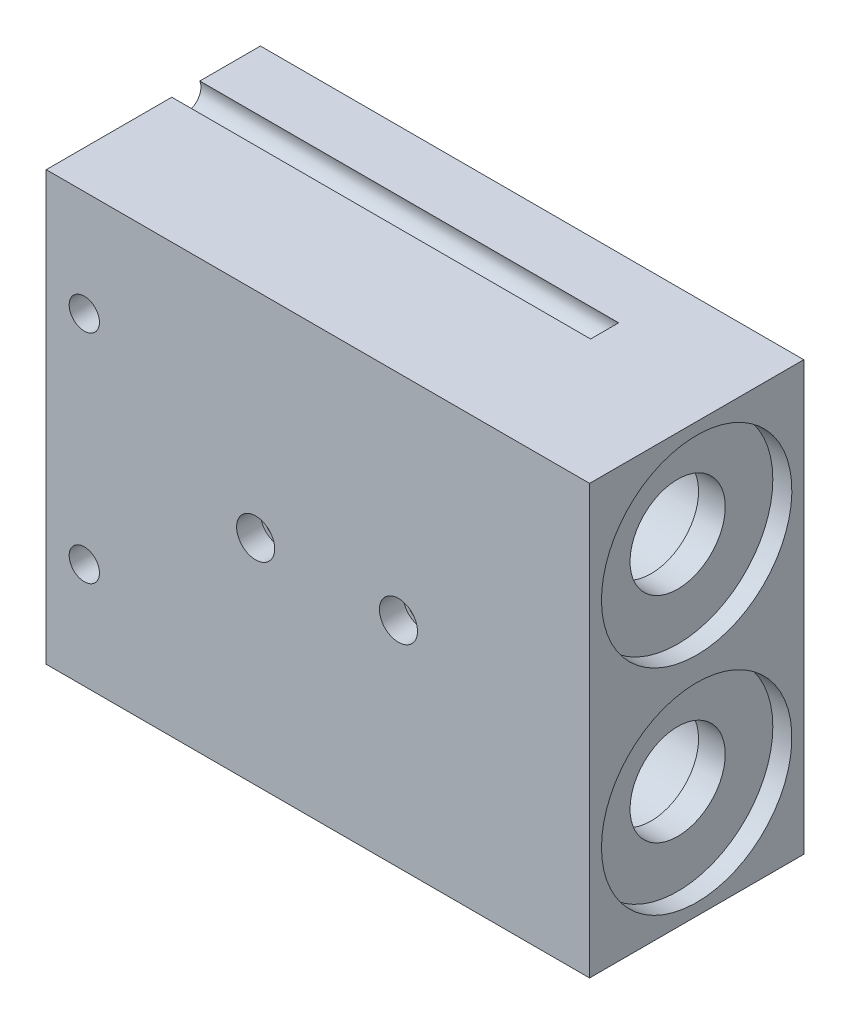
ISO-10303-21;
HEADER;
FILE_DESCRIPTION(('STEP AP214'),'2;1');
FILE_NAME('part.step','',(''),(''),'','','');
FILE_SCHEMA(('AUTOMOTIVE_DESIGN { 1 0 10303 214 1 1 1 1 }'));
ENDSEC;
DATA;
#1=APPLICATION_CONTEXT('core data for automotive mechanical design processes');
#2=APPLICATION_PROTOCOL_DEFINITION('international standard','automotive_design',2000,#1);
#3=PRODUCT_CONTEXT('',#1,'mechanical');
#4=PRODUCT('Part','Part','',(#3));
#5=PRODUCT_RELATED_PRODUCT_CATEGORY('part','',(#4));
#6=PRODUCT_DEFINITION_FORMATION('','',#4);
#7=PRODUCT_DEFINITION_CONTEXT('part definition',#1,'design');
#8=PRODUCT_DEFINITION('design','',#6,#7);
#9=PRODUCT_DEFINITION_SHAPE('','',#8);
#10=(LENGTH_UNIT() NAMED_UNIT(*) SI_UNIT(.MILLI.,.METRE.));
#11=(NAMED_UNIT(*) PLANE_ANGLE_UNIT() SI_UNIT($,.RADIAN.));
#12=(NAMED_UNIT(*) SI_UNIT($,.STERADIAN.) SOLID_ANGLE_UNIT());
#13=UNCERTAINTY_MEASURE_WITH_UNIT(LENGTH_MEASURE(1.E-05),#10,'distance_accuracy_value','');
#14=(GEOMETRIC_REPRESENTATION_CONTEXT(3) GLOBAL_UNCERTAINTY_ASSIGNED_CONTEXT((#13)) GLOBAL_UNIT_ASSIGNED_CONTEXT((#10,
#11,#12)) REPRESENTATION_CONTEXT('',''));
#15=CARTESIAN_POINT('',(0.,0.,0.));
#16=DIRECTION('',(0.,0.,1.));
#17=DIRECTION('',(1.,0.,0.));
#18=AXIS2_PLACEMENT_3D('',#15,#16,#17);
#19=CARTESIAN_POINT('',(-29.1465,-14.4779999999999,7.93749999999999));
#20=DIRECTION('',(0.,0.,1.));
#21=DIRECTION('',(1.,0.,0.));
#22=AXIS2_PLACEMENT_3D('',#19,#20,#21);
#23=PLANE('',#22);
#24=CARTESIAN_POINT('',(-31.1658,-14.4779999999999,7.93749999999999));
#25=DIRECTION('',(0.,0.,-1.));
#26=DIRECTION('',(-1.,0.,0.));
#27=AXIS2_PLACEMENT_3D('',#24,#25,#26);
#28=CIRCLE('',#27,2.0193);
#29=CARTESIAN_POINT('',(-33.1851,-14.4779999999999,7.93749999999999));
#30=VERTEX_POINT('',#29);
#31=EDGE_CURVE('E214',#30,#30,#28,.F.);
#32=ORIENTED_EDGE('',*,*,#31,.T.);
#33=EDGE_LOOP('',(#32));
#34=FACE_BOUND('',#33,.T.);
#35=ADVANCED_FACE('F32',(#34),#23,.T.);
#36=CARTESIAN_POINT('',(-29.1465,14.478,7.93749999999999));
#37=DIRECTION('',(0.,0.,1.));
#38=DIRECTION('',(1.,0.,0.));
#39=AXIS2_PLACEMENT_3D('',#36,#37,#38);
#40=PLANE('',#39);
#41=CARTESIAN_POINT('',(-31.1658,14.478,7.93749999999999));
#42=DIRECTION('',(0.,0.,-1.));
#43=DIRECTION('',(-1.,0.,0.));
#44=AXIS2_PLACEMENT_3D('',#41,#42,#43);
#45=CIRCLE('',#44,2.0193);
#46=CARTESIAN_POINT('',(-33.1851,14.478,7.93749999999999));
#47=VERTEX_POINT('',#46);
#48=EDGE_CURVE('E211',#47,#47,#45,.F.);
#49=ORIENTED_EDGE('',*,*,#48,.T.);
#50=EDGE_LOOP('',(#49));
#51=FACE_BOUND('',#50,.T.);
#52=ADVANCED_FACE('F613',(#51),#40,.T.);
#53=CARTESIAN_POINT('',(-5.76579999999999,0.,11.1125));
#54=DIRECTION('',(0.,0.,1.));
#55=DIRECTION('',(1.,0.,0.));
#56=AXIS2_PLACEMENT_3D('',#53,#54,#55);
#57=PLANE('',#56);
#58=CARTESIAN_POINT('',(-8.3058,0.,11.1125));
#59=DIRECTION('',(0.,0.,-1.));
#60=DIRECTION('',(-1.,0.,0.));
#61=AXIS2_PLACEMENT_3D('',#58,#59,#60);
#62=CIRCLE('',#61,2.0193);
#63=CARTESIAN_POINT('',(-10.3251,0.,11.1125));
#64=VERTEX_POINT('',#63);
#65=EDGE_CURVE('E202',#64,#64,#62,.T.);
#66=ORIENTED_EDGE('',*,*,#65,.T.);
#67=EDGE_LOOP('',(#66));
#68=FACE_BOUND('',#67,.T.);
#69=CARTESIAN_POINT('',(-8.3058,0.,11.1125));
#70=DIRECTION('',(0.,0.,-1.));
#71=DIRECTION('',(-1.,0.,0.));
#72=AXIS2_PLACEMENT_3D('',#69,#70,#71);
#73=CIRCLE('',#72,2.54);
#74=CARTESIAN_POINT('',(-10.8458,0.,11.1125));
#75=VERTEX_POINT('',#74);
#76=EDGE_CURVE('E208',#75,#75,#73,.F.);
#77=ORIENTED_EDGE('',*,*,#76,.T.);
#78=EDGE_LOOP('',(#77));
#79=FACE_BOUND('',#78,.T.);
#80=ADVANCED_FACE('F425',(#68,#79),#57,.T.);
#81=CARTESIAN_POINT('',(13.2842,0.,11.1125));
#82=DIRECTION('',(0.,0.,1.));
#83=DIRECTION('',(1.,0.,0.));
#84=AXIS2_PLACEMENT_3D('',#81,#82,#83);
#85=PLANE('',#84);
#86=CARTESIAN_POINT('',(10.7442,0.,11.1125));
#87=DIRECTION('',(0.,0.,-1.));
#88=DIRECTION('',(-1.,0.,0.));
#89=AXIS2_PLACEMENT_3D('',#86,#87,#88);
#90=CIRCLE('',#89,2.0193);
#91=CARTESIAN_POINT('',(8.72489999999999,0.,11.1125));
#92=VERTEX_POINT('',#91);
#93=EDGE_CURVE('E107',#92,#92,#90,.T.);
#94=ORIENTED_EDGE('',*,*,#93,.T.);
#95=EDGE_LOOP('',(#94));
#96=FACE_BOUND('',#95,.T.);
#97=CARTESIAN_POINT('',(10.7442,0.,11.1125));
#98=DIRECTION('',(0.,0.,-1.));
#99=DIRECTION('',(-1.,0.,0.));
#100=AXIS2_PLACEMENT_3D('',#97,#98,#99);
#101=CIRCLE('',#100,2.54);
#102=CARTESIAN_POINT('',(8.20419999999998,0.,11.1125));
#103=VERTEX_POINT('',#102);
#104=EDGE_CURVE('E205',#103,#103,#101,.F.);
#105=ORIENTED_EDGE('',*,*,#104,.T.);
#106=EDGE_LOOP('',(#105));
#107=FACE_BOUND('',#106,.T.);
#108=ADVANCED_FACE('F416',(#96,#107),#85,.T.);
#109=CARTESIAN_POINT('',(-33.2458,17.4694272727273,-6.6675));
#110=DIRECTION('',(1.,0.,0.));
#111=DIRECTION('',(0.,0.,-1.));
#112=AXIS2_PLACEMENT_3D('',#109,#110,#111);
#113=PLANE('',#112);
#114=CARTESIAN_POINT('',(-33.2458,17.6530000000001,-6.6675));
#115=DIRECTION('',(-1.,0.,0.));
#116=DIRECTION('',(0.,-1.,0.));
#117=AXIS2_PLACEMENT_3D('',#114,#115,#116);
#118=CIRCLE('',#117,2.0193);
#119=CARTESIAN_POINT('',(-33.2458,15.6337000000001,-6.6675));
#120=VERTEX_POINT('',#119);
#121=EDGE_CURVE('E106',#120,#120,#118,.T.);
#122=ORIENTED_EDGE('',*,*,#121,.T.);
#123=EDGE_LOOP('',(#122));
#124=FACE_BOUND('',#123,.T.);
#125=ADVANCED_FACE('F413',(#124),#113,.F.);
#126=CARTESIAN_POINT('',(-33.2458,-11.4865727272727,-6.6675));
#127=DIRECTION('',(1.,0.,0.));
#128=DIRECTION('',(0.,0.,-1.));
#129=AXIS2_PLACEMENT_3D('',#126,#127,#128);
#130=PLANE('',#129);
#131=CARTESIAN_POINT('',(-33.2458,-11.303,-6.6675));
#132=DIRECTION('',(-1.,0.,0.));
#133=DIRECTION('',(0.,-1.,0.));
#134=AXIS2_PLACEMENT_3D('',#131,#132,#133);
#135=CIRCLE('',#134,2.0193);
#136=CARTESIAN_POINT('',(-33.2458,-13.3223,-6.6675));
#137=VERTEX_POINT('',#136);
#138=EDGE_CURVE('E195',#137,#137,#135,.T.);
#139=ORIENTED_EDGE('',*,*,#138,.T.);
#140=EDGE_LOOP('',(#139));
#141=FACE_BOUND('',#140,.T.);
#142=ADVANCED_FACE('F415',(#141),#130,.F.);
#143=CARTESIAN_POINT('',(-31.1658,-14.4779999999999,14.2875));
#144=DIRECTION('',(0.,0.,-1.));
#145=DIRECTION('',(-1.,0.,0.));
#146=AXIS2_PLACEMENT_3D('',#143,#144,#145);
#147=CYLINDRICAL_SURFACE('',#146,2.0193);
#148=CARTESIAN_POINT('',(-31.1658,-14.4779999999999,14.2875));
#149=DIRECTION('',(0.,0.,-1.));
#150=DIRECTION('',(-1.,0.,0.));
#151=AXIS2_PLACEMENT_3D('',#148,#149,#150);
#152=CIRCLE('',#151,2.0193);
#153=CARTESIAN_POINT('',(-33.1851,-14.4779999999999,14.2875));
#154=VERTEX_POINT('',#153);
#155=EDGE_CURVE('E190',#154,#154,#152,.T.);
#156=ORIENTED_EDGE('',*,*,#155,.F.);
#157=EDGE_LOOP('',(#156));
#158=FACE_BOUND('',#157,.T.);
#159=ORIENTED_EDGE('',*,*,#31,.F.);
#160=EDGE_LOOP('',(#159));
#161=FACE_BOUND('',#160,.T.);
#162=ADVANCED_FACE('F422',(#158,#161),#147,.F.);
#163=CARTESIAN_POINT('',(-31.1658,14.478,14.2875));
#164=DIRECTION('',(0.,0.,-1.));
#165=DIRECTION('',(-1.,0.,0.));
#166=AXIS2_PLACEMENT_3D('',#163,#164,#165);
#167=CYLINDRICAL_SURFACE('',#166,2.0193);
#168=CARTESIAN_POINT('',(-31.1658,14.478,14.2875));
#169=DIRECTION('',(0.,0.,-1.));
#170=DIRECTION('',(-1.,0.,0.));
#171=AXIS2_PLACEMENT_3D('',#168,#169,#170);
#172=CIRCLE('',#171,2.0193);
#173=CARTESIAN_POINT('',(-33.1851,14.478,14.2875));
#174=VERTEX_POINT('',#173);
#175=EDGE_CURVE('E187',#174,#174,#172,.T.);
#176=ORIENTED_EDGE('',*,*,#175,.F.);
#177=EDGE_LOOP('',(#176));
#178=FACE_BOUND('',#177,.T.);
#179=ORIENTED_EDGE('',*,*,#48,.F.);
#180=EDGE_LOOP('',(#179));
#181=FACE_BOUND('',#180,.T.);
#182=ADVANCED_FACE('F432',(#178,#181),#167,.F.);
#183=CARTESIAN_POINT('',(-8.3058,0.,14.2875));
#184=DIRECTION('',(0.,0.,-1.));
#185=DIRECTION('',(-1.,0.,0.));
#186=AXIS2_PLACEMENT_3D('',#183,#184,#185);
#187=CYLINDRICAL_SURFACE('',#186,2.54);
#188=CARTESIAN_POINT('',(-8.3058,0.,14.2875));
#189=DIRECTION('',(0.,0.,-1.));
#190=DIRECTION('',(-1.,0.,0.));
#191=AXIS2_PLACEMENT_3D('',#188,#189,#190);
#192=CIRCLE('',#191,2.54);
#193=CARTESIAN_POINT('',(-10.8458,0.,14.2875));
#194=VERTEX_POINT('',#193);
#195=EDGE_CURVE('E184',#194,#194,#192,.T.);
#196=ORIENTED_EDGE('',*,*,#195,.F.);
#197=EDGE_LOOP('',(#196));
#198=FACE_BOUND('',#197,.T.);
#199=ORIENTED_EDGE('',*,*,#76,.F.);
#200=EDGE_LOOP('',(#199));
#201=FACE_BOUND('',#200,.T.);
#202=ADVANCED_FACE('F436',(#198,#201),#187,.F.);
#203=CARTESIAN_POINT('',(10.7442,0.,14.2875));
#204=DIRECTION('',(0.,0.,-1.));
#205=DIRECTION('',(-1.,0.,0.));
#206=AXIS2_PLACEMENT_3D('',#203,#204,#205);
#207=CYLINDRICAL_SURFACE('',#206,2.54);
#208=CARTESIAN_POINT('',(10.7442,0.,14.2875));
#209=DIRECTION('',(0.,0.,-1.));
#210=DIRECTION('',(-1.,0.,0.));
#211=AXIS2_PLACEMENT_3D('',#208,#209,#210);
#212=CIRCLE('',#211,2.54);
#213=CARTESIAN_POINT('',(8.20419999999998,0.,14.2875));
#214=VERTEX_POINT('',#213);
#215=EDGE_CURVE('E181',#214,#214,#212,.T.);
#216=ORIENTED_EDGE('',*,*,#215,.F.);
#217=EDGE_LOOP('',(#216));
#218=FACE_BOUND('',#217,.T.);
#219=ORIENTED_EDGE('',*,*,#104,.F.);
#220=EDGE_LOOP('',(#219));
#221=FACE_BOUND('',#220,.T.);
#222=ADVANCED_FACE('F440',(#218,#221),#207,.F.);
#223=CARTESIAN_POINT('',(-8.3058,0.,11.1125));
#224=DIRECTION('',(0.,0.,-1.));
#225=DIRECTION('',(-1.,0.,0.));
#226=AXIS2_PLACEMENT_3D('',#223,#224,#225);
#227=CYLINDRICAL_SURFACE('',#226,2.0193);
#228=CARTESIAN_POINT('',(-8.3058,0.,-7.9375));
#229=DIRECTION('',(0.,0.,-1.));
#230=DIRECTION('',(-1.,0.,0.));
#231=AXIS2_PLACEMENT_3D('',#228,#229,#230);
#232=CIRCLE('',#231,2.0193);
#233=CARTESIAN_POINT('',(-10.3251,0.,-7.9375));
#234=VERTEX_POINT('',#233);
#235=EDGE_CURVE('E178',#234,#234,#232,.T.);
#236=ORIENTED_EDGE('',*,*,#235,.T.);
#237=EDGE_LOOP('',(#236));
#238=FACE_BOUND('',#237,.T.);
#239=ORIENTED_EDGE('',*,*,#65,.F.);
#240=EDGE_LOOP('',(#239));
#241=FACE_BOUND('',#240,.T.);
#242=ADVANCED_FACE('F444',(#238,#241),#227,.F.);
#243=CARTESIAN_POINT('',(10.7442,0.,11.1125));
#244=DIRECTION('',(0.,0.,-1.));
#245=DIRECTION('',(-1.,0.,0.));
#246=AXIS2_PLACEMENT_3D('',#243,#244,#245);
#247=CYLINDRICAL_SURFACE('',#246,2.0193);
#248=CARTESIAN_POINT('',(10.7442,0.,-7.9375));
#249=DIRECTION('',(0.,0.,-1.));
#250=DIRECTION('',(-1.,0.,0.));
#251=AXIS2_PLACEMENT_3D('',#248,#249,#250);
#252=CIRCLE('',#251,2.0193);
#253=CARTESIAN_POINT('',(8.72489999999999,0.,-7.9375));
#254=VERTEX_POINT('',#253);
#255=EDGE_CURVE('E175',#254,#254,#252,.T.);
#256=ORIENTED_EDGE('',*,*,#255,.T.);
#257=EDGE_LOOP('',(#256));
#258=FACE_BOUND('',#257,.T.);
#259=ORIENTED_EDGE('',*,*,#93,.F.);
#260=EDGE_LOOP('',(#259));
#261=FACE_BOUND('',#260,.T.);
#262=ADVANCED_FACE('F448',(#258,#261),#247,.F.);
#263=CARTESIAN_POINT('',(19.6342,29.8323,-4.3307));
#264=DIRECTION('',(1.,0.,0.));
#265=DIRECTION('',(0.,0.,-1.));
#266=AXIS2_PLACEMENT_3D('',#263,#264,#265);
#267=PLANE('',#266);
#268=DIRECTION('',(0.,0.,-1.));
#269=VECTOR('',#268,1.);
#270=CARTESIAN_POINT('',(19.6342,28.5749999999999,0.));
#271=LINE('',#270,#269);
#272=CARTESIAN_POINT('',(19.6342,28.5749999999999,-2.46069238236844));
#273=VERTEX_POINT('',#272);
#274=CARTESIAN_POINT('',(19.6342,28.5749999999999,-6.20070761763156));
#275=VERTEX_POINT('',#274);
#276=EDGE_CURVE('E111',#273,#275,#271,.T.);
#277=ORIENTED_EDGE('',*,*,#276,.T.);
#278=CARTESIAN_POINT('',(19.6342,27.813,-4.3307));
#279=DIRECTION('',(1.,0.,0.));
#280=DIRECTION('',(0.,1.,0.));
#281=AXIS2_PLACEMENT_3D('',#278,#279,#280);
#282=CIRCLE('',#281,2.0193);
#283=EDGE_CURVE('E95',#275,#273,#282,.F.);
#284=ORIENTED_EDGE('',*,*,#283,.T.);
#285=EDGE_LOOP('',(#277,#284));
#286=FACE_BOUND('',#285,.T.);
#287=ADVANCED_FACE('F116',(#286),#267,.F.);
#288=CARTESIAN_POINT('',(-36.2458,27.8130000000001,-4.3307));
#289=DIRECTION('',(1.,0.,0.));
#290=DIRECTION('',(0.,1.,0.));
#291=AXIS2_PLACEMENT_3D('',#288,#289,#290);
#292=CYLINDRICAL_SURFACE('',#291,2.0193);
#293=CARTESIAN_POINT('',(-36.2458,27.8130000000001,-4.3307));
#294=DIRECTION('',(1.,0.,0.));
#295=DIRECTION('',(0.,1.,0.));
#296=AXIS2_PLACEMENT_3D('',#293,#294,#295);
#297=CIRCLE('',#296,2.0193);
#298=CARTESIAN_POINT('',(-36.2458,28.575,-6.20070761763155));
#299=VERTEX_POINT('',#298);
#300=CARTESIAN_POINT('',(-36.2458,28.575,-2.46069238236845));
#301=VERTEX_POINT('',#300);
#302=EDGE_CURVE('E170',#299,#301,#297,.F.);
#303=ORIENTED_EDGE('',*,*,#302,.T.);
#304=DIRECTION('',(1.,0.,0.));
#305=VECTOR('',#304,1.);
#306=CARTESIAN_POINT('',(0.,28.5749999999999,-2.46069238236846));
#307=LINE('',#306,#305);
#308=EDGE_CURVE('E105',#301,#273,#307,.T.);
#309=ORIENTED_EDGE('',*,*,#308,.T.);
#310=ORIENTED_EDGE('',*,*,#283,.F.);
#311=DIRECTION('',(1.,0.,0.));
#312=VECTOR('',#311,1.);
#313=CARTESIAN_POINT('',(0.,28.5749999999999,-6.20070761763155));
#314=LINE('',#313,#312);
#315=EDGE_CURVE('E103',#275,#299,#314,.F.);
#316=ORIENTED_EDGE('',*,*,#315,.T.);
#317=EDGE_LOOP('',(#303,#309,#310,#316));
#318=FACE_BOUND('',#317,.T.);
#319=ADVANCED_FACE('F102',(#318),#292,.F.);
#320=CARTESIAN_POINT('',(-33.2458,17.6530000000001,-6.6675));
#321=DIRECTION('',(-1.,0.,0.));
#322=DIRECTION('',(0.,-1.,0.));
#323=AXIS2_PLACEMENT_3D('',#320,#321,#322);
#324=CYLINDRICAL_SURFACE('',#323,2.0193);
#325=CARTESIAN_POINT('',(-36.2457999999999,17.6530000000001,-6.6675));
#326=DIRECTION('',(-1.,0.,0.));
#327=DIRECTION('',(0.,-1.,0.));
#328=AXIS2_PLACEMENT_3D('',#325,#326,#327);
#329=CIRCLE('',#328,2.0193);
#330=CARTESIAN_POINT('',(-36.2457999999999,15.6337000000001,-6.6675));
#331=VERTEX_POINT('',#330);
#332=EDGE_CURVE('E167',#331,#331,#329,.T.);
#333=ORIENTED_EDGE('',*,*,#332,.T.);
#334=EDGE_LOOP('',(#333));
#335=FACE_BOUND('',#334,.T.);
#336=ORIENTED_EDGE('',*,*,#121,.F.);
#337=EDGE_LOOP('',(#336));
#338=FACE_BOUND('',#337,.T.);
#339=ADVANCED_FACE('F406',(#335,#338),#324,.F.);
#340=CARTESIAN_POINT('',(-33.2458,-11.303,-6.6675));
#341=DIRECTION('',(-1.,0.,0.));
#342=DIRECTION('',(0.,-1.,0.));
#343=AXIS2_PLACEMENT_3D('',#340,#341,#342);
#344=CYLINDRICAL_SURFACE('',#343,2.0193);
#345=CARTESIAN_POINT('',(-36.2458,-11.303,-6.6675));
#346=DIRECTION('',(-1.,0.,0.));
#347=DIRECTION('',(0.,-1.,0.));
#348=AXIS2_PLACEMENT_3D('',#345,#346,#347);
#349=CIRCLE('',#348,2.0193);
#350=CARTESIAN_POINT('',(-36.2458,-13.3223,-6.6675));
#351=VERTEX_POINT('',#350);
#352=EDGE_CURVE('E163',#351,#351,#349,.T.);
#353=ORIENTED_EDGE('',*,*,#352,.T.);
#354=EDGE_LOOP('',(#353));
#355=FACE_BOUND('',#354,.T.);
#356=ORIENTED_EDGE('',*,*,#138,.F.);
#357=EDGE_LOOP('',(#356));
#358=FACE_BOUND('',#357,.T.);
#359=ADVANCED_FACE('F409',(#355,#358),#344,.F.);
#360=CARTESIAN_POINT('',(19.6342,-25.7937,-4.3307));
#361=DIRECTION('',(1.,0.,0.));
#362=DIRECTION('',(0.,0.,-1.));
#363=AXIS2_PLACEMENT_3D('',#360,#361,#362);
#364=PLANE('',#363);
#365=CARTESIAN_POINT('',(19.6341999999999,-27.813,-4.3307));
#366=DIRECTION('',(1.,0.,0.));
#367=DIRECTION('',(0.,1.,0.));
#368=AXIS2_PLACEMENT_3D('',#365,#366,#367);
#369=CIRCLE('',#368,2.0193);
#370=CARTESIAN_POINT('',(19.6341999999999,-28.575,-2.46069238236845));
#371=VERTEX_POINT('',#370);
#372=CARTESIAN_POINT('',(19.6341999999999,-28.575,-6.20070761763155));
#373=VERTEX_POINT('',#372);
#374=EDGE_CURVE('E193',#371,#373,#369,.F.);
#375=ORIENTED_EDGE('',*,*,#374,.T.);
#376=DIRECTION('',(0.,0.,1.));
#377=VECTOR('',#376,1.);
#378=CARTESIAN_POINT('',(19.6341999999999,-28.575,0.));
#379=LINE('',#378,#377);
#380=EDGE_CURVE('E272',#373,#371,#379,.T.);
#381=ORIENTED_EDGE('',*,*,#380,.T.);
#382=EDGE_LOOP('',(#375,#381));
#383=FACE_BOUND('',#382,.T.);
#384=ADVANCED_FACE('F322',(#383),#364,.F.);
#385=CARTESIAN_POINT('',(-36.2458,-27.8129999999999,-4.3307));
#386=DIRECTION('',(1.,0.,0.));
#387=DIRECTION('',(0.,1.,0.));
#388=AXIS2_PLACEMENT_3D('',#385,#386,#387);
#389=CYLINDRICAL_SURFACE('',#388,2.0193);
#390=ORIENTED_EDGE('',*,*,#374,.F.);
#391=DIRECTION('',(1.,0.,0.));
#392=VECTOR('',#391,1.);
#393=CARTESIAN_POINT('',(0.,-28.575,-2.46069238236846));
#394=LINE('',#393,#392);
#395=CARTESIAN_POINT('',(-36.2458,-28.575,-2.46069238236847));
#396=VERTEX_POINT('',#395);
#397=EDGE_CURVE('E132',#371,#396,#394,.F.);
#398=ORIENTED_EDGE('',*,*,#397,.T.);
#399=CARTESIAN_POINT('',(-36.2458,-27.8129999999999,-4.3307));
#400=DIRECTION('',(1.,0.,0.));
#401=DIRECTION('',(0.,1.,0.));
#402=AXIS2_PLACEMENT_3D('',#399,#400,#401);
#403=CIRCLE('',#402,2.0193);
#404=CARTESIAN_POINT('',(-36.2458,-28.575,-6.20070761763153));
#405=VERTEX_POINT('',#404);
#406=EDGE_CURVE('E172',#396,#405,#403,.F.);
#407=ORIENTED_EDGE('',*,*,#406,.T.);
#408=DIRECTION('',(1.,0.,0.));
#409=VECTOR('',#408,1.);
#410=CARTESIAN_POINT('',(0.,-28.575,-6.20070761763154));
#411=LINE('',#410,#409);
#412=EDGE_CURVE('E269',#405,#373,#411,.T.);
#413=ORIENTED_EDGE('',*,*,#412,.T.);
#414=EDGE_LOOP('',(#390,#398,#407,#413));
#415=FACE_BOUND('',#414,.T.);
#416=ADVANCED_FACE('F319',(#415),#389,.F.);
#417=CARTESIAN_POINT('',(0.,0.,14.2875));
#418=DIRECTION('',(0.,0.,1.));
#419=DIRECTION('',(1.,0.,0.));
#420=AXIS2_PLACEMENT_3D('',#417,#418,#419);
#421=PLANE('',#420);
#422=ORIENTED_EDGE('',*,*,#215,.T.);
#423=EDGE_LOOP('',(#422));
#424=FACE_BOUND('',#423,.T.);
#425=ORIENTED_EDGE('',*,*,#195,.T.);
#426=EDGE_LOOP('',(#425));
#427=FACE_BOUND('',#426,.T.);
#428=ORIENTED_EDGE('',*,*,#175,.T.);
#429=EDGE_LOOP('',(#428));
#430=FACE_BOUND('',#429,.T.);
#431=ORIENTED_EDGE('',*,*,#155,.T.);
#432=EDGE_LOOP('',(#431));
#433=FACE_BOUND('',#432,.T.);
#434=DIRECTION('',(0.,1.,0.));
#435=VECTOR('',#434,1.);
#436=CARTESIAN_POINT('',(-36.2458,0.,14.2875));
#437=LINE('',#436,#435);
#438=CARTESIAN_POINT('',(-36.2458,28.575,14.2875));
#439=VERTEX_POINT('',#438);
#440=CARTESIAN_POINT('',(-36.2458,-28.575,14.2875));
#441=VERTEX_POINT('',#440);
#442=EDGE_CURVE('E174',#439,#441,#437,.F.);
#443=ORIENTED_EDGE('',*,*,#442,.T.);
#444=DIRECTION('',(1.,0.,0.));
#445=VECTOR('',#444,1.);
#446=CARTESIAN_POINT('',(0.,-28.575,14.2875));
#447=LINE('',#446,#445);
#448=CARTESIAN_POINT('',(36.2457999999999,-28.575,14.2875));
#449=VERTEX_POINT('',#448);
#450=EDGE_CURVE('E280',#441,#449,#447,.T.);
#451=ORIENTED_EDGE('',*,*,#450,.T.);
#452=DIRECTION('',(0.,1.,0.));
#453=VECTOR('',#452,1.);
#454=CARTESIAN_POINT('',(36.2458,0.,14.2875));
#455=LINE('',#454,#453);
#456=CARTESIAN_POINT('',(36.2458,28.5749999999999,14.2875));
#457=VERTEX_POINT('',#456);
#458=EDGE_CURVE('E127',#449,#457,#455,.T.);
#459=ORIENTED_EDGE('',*,*,#458,.T.);
#460=DIRECTION('',(1.,0.,0.));
#461=VECTOR('',#460,1.);
#462=CARTESIAN_POINT('',(0.,28.5749999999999,14.2875));
#463=LINE('',#462,#461);
#464=EDGE_CURVE('E118',#457,#439,#463,.F.);
#465=ORIENTED_EDGE('',*,*,#464,.T.);
#466=EDGE_LOOP('',(#443,#451,#459,#465));
#467=FACE_BOUND('',#466,.T.);
#468=ADVANCED_FACE('F307',(#424,#427,#430,#433,#467),#421,.T.);
#469=CARTESIAN_POINT('',(36.2458,14.2874999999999,0.));
#470=DIRECTION('',(-1.,0.,0.));
#471=DIRECTION('',(0.,-1.,0.));
#472=AXIS2_PLACEMENT_3D('',#469,#470,#471);
#473=CYLINDRICAL_SURFACE('',#472,12.7);
#474=CARTESIAN_POINT('',(36.2458,14.2874999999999,0.));
#475=DIRECTION('',(-1.,0.,0.));
#476=DIRECTION('',(0.,-1.,0.));
#477=AXIS2_PLACEMENT_3D('',#474,#475,#476);
#478=CIRCLE('',#477,12.7);
#479=CARTESIAN_POINT('',(36.2458,1.58749999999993,0.));
#480=VERTEX_POINT('',#479);
#481=EDGE_CURVE('E160',#480,#480,#478,.F.);
#482=ORIENTED_EDGE('',*,*,#481,.T.);
#483=EDGE_LOOP('',(#482));
#484=FACE_BOUND('',#483,.T.);
#485=CARTESIAN_POINT('',(33.7058,14.2874999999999,0.));
#486=DIRECTION('',(1.,0.,0.));
#487=DIRECTION('',(0.,0.,-1.));
#488=AXIS2_PLACEMENT_3D('',#485,#486,#487);
#489=CIRCLE('',#488,12.7);
#490=CARTESIAN_POINT('',(33.7058,14.2874999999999,-12.7));
#491=VERTEX_POINT('',#490);
#492=EDGE_CURVE('E256',#491,#491,#489,.T.);
#493=ORIENTED_EDGE('',*,*,#492,.F.);
#494=EDGE_LOOP('',(#493));
#495=FACE_BOUND('',#494,.T.);
#496=ADVANCED_FACE('F466',(#484,#495),#473,.F.);
#497=CARTESIAN_POINT('',(36.2458,-14.2875000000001,0.));
#498=DIRECTION('',(-1.,0.,0.));
#499=DIRECTION('',(0.,0.,1.));
#500=AXIS2_PLACEMENT_3D('',#497,#498,#499);
#501=CYLINDRICAL_SURFACE('',#500,12.7);
#502=CARTESIAN_POINT('',(36.2458,-14.2875000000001,0.));
#503=DIRECTION('',(-1.,0.,0.));
#504=DIRECTION('',(0.,0.,1.));
#505=AXIS2_PLACEMENT_3D('',#502,#503,#504);
#506=CIRCLE('',#505,12.7);
#507=CARTESIAN_POINT('',(36.2458,-14.2875000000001,12.7));
#508=VERTEX_POINT('',#507);
#509=EDGE_CURVE('E157',#508,#508,#506,.F.);
#510=ORIENTED_EDGE('',*,*,#509,.T.);
#511=EDGE_LOOP('',(#510));
#512=FACE_BOUND('',#511,.T.);
#513=CARTESIAN_POINT('',(33.7058,-14.2875000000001,0.));
#514=DIRECTION('',(1.,0.,0.));
#515=DIRECTION('',(0.,0.,-1.));
#516=AXIS2_PLACEMENT_3D('',#513,#514,#515);
#517=CIRCLE('',#516,12.7);
#518=CARTESIAN_POINT('',(33.7058,-14.2875000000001,-12.7));
#519=VERTEX_POINT('',#518);
#520=EDGE_CURVE('E248',#519,#519,#517,.T.);
#521=ORIENTED_EDGE('',*,*,#520,.F.);
#522=EDGE_LOOP('',(#521));
#523=FACE_BOUND('',#522,.T.);
#524=ADVANCED_FACE('F390',(#512,#523),#501,.F.);
#525=CARTESIAN_POINT('',(-6.26109999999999,0.,-7.9375));
#526=DIRECTION('',(0.,0.,1.));
#527=DIRECTION('',(1.,0.,0.));
#528=AXIS2_PLACEMENT_3D('',#525,#526,#527);
#529=PLANE('',#528);
#530=ORIENTED_EDGE('',*,*,#235,.F.);
#531=EDGE_LOOP('',(#530));
#532=FACE_BOUND('',#531,.T.);
#533=CARTESIAN_POINT('',(-8.3058,0.,-7.9375));
#534=DIRECTION('',(0.,0.,1.));
#535=DIRECTION('',(1.,0.,0.));
#536=AXIS2_PLACEMENT_3D('',#533,#534,#535);
#537=CIRCLE('',#536,2.0447);
#538=CARTESIAN_POINT('',(-6.2611,0.,-7.9375));
#539=VERTEX_POINT('',#538);
#540=EDGE_CURVE('E154',#539,#539,#537,.F.);
#541=ORIENTED_EDGE('',*,*,#540,.T.);
#542=EDGE_LOOP('',(#541));
#543=FACE_BOUND('',#542,.T.);
#544=ADVANCED_FACE('F381',(#532,#543),#529,.F.);
#545=CARTESIAN_POINT('',(12.7889,0.,-7.9375));
#546=DIRECTION('',(0.,0.,1.));
#547=DIRECTION('',(1.,0.,0.));
#548=AXIS2_PLACEMENT_3D('',#545,#546,#547);
#549=PLANE('',#548);
#550=ORIENTED_EDGE('',*,*,#255,.F.);
#551=EDGE_LOOP('',(#550));
#552=FACE_BOUND('',#551,.T.);
#553=CARTESIAN_POINT('',(10.7442,0.,-7.9375));
#554=DIRECTION('',(0.,0.,1.));
#555=DIRECTION('',(1.,0.,0.));
#556=AXIS2_PLACEMENT_3D('',#553,#554,#555);
#557=CIRCLE('',#556,2.0447);
#558=CARTESIAN_POINT('',(12.7889,0.,-7.9375));
#559=VERTEX_POINT('',#558);
#560=EDGE_CURVE('E151',#559,#559,#557,.F.);
#561=ORIENTED_EDGE('',*,*,#560,.T.);
#562=EDGE_LOOP('',(#561));
#563=FACE_BOUND('',#562,.T.);
#564=ADVANCED_FACE('F378',(#552,#563),#549,.F.);
#565=CARTESIAN_POINT('',(3.61949999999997,-25.4,-7.9375));
#566=DIRECTION('',(0.,0.,1.));
#567=DIRECTION('',(1.,0.,0.));
#568=AXIS2_PLACEMENT_3D('',#565,#566,#567);
#569=PLANE('',#568);
#570=CARTESIAN_POINT('',(1.21919999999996,-25.4,-7.9375));
#571=DIRECTION('',(0.,0.,1.));
#572=DIRECTION('',(1.,0.,0.));
#573=AXIS2_PLACEMENT_3D('',#570,#571,#572);
#574=CIRCLE('',#573,2.4003);
#575=CARTESIAN_POINT('',(3.61949999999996,-25.4,-7.9375));
#576=VERTEX_POINT('',#575);
#577=EDGE_CURVE('E147',#576,#576,#574,.F.);
#578=ORIENTED_EDGE('',*,*,#577,.T.);
#579=EDGE_LOOP('',(#578));
#580=FACE_BOUND('',#579,.T.);
#581=ADVANCED_FACE('F380',(#580),#569,.F.);
#582=CARTESIAN_POINT('',(0.,28.5749999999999,0.));
#583=DIRECTION('',(0.,-1.,0.));
#584=DIRECTION('',(0.,0.,-1.));
#585=AXIS2_PLACEMENT_3D('',#582,#583,#584);
#586=PLANE('',#585);
#587=ORIENTED_EDGE('',*,*,#276,.F.);
#588=ORIENTED_EDGE('',*,*,#308,.F.);
#589=DIRECTION('',(0.,0.,-1.));
#590=VECTOR('',#589,1.);
#591=CARTESIAN_POINT('',(-36.2458,28.5750000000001,0.));
#592=LINE('',#591,#590);
#593=EDGE_CURVE('E114',#301,#439,#592,.F.);
#594=ORIENTED_EDGE('',*,*,#593,.T.);
#595=ORIENTED_EDGE('',*,*,#464,.F.);
#596=DIRECTION('',(0.,0.,1.));
#597=VECTOR('',#596,1.);
#598=CARTESIAN_POINT('',(36.2458,28.5749999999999,0.));
#599=LINE('',#598,#597);
#600=CARTESIAN_POINT('',(36.2458,28.5749999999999,-14.2875));
#601=VERTEX_POINT('',#600);
#602=EDGE_CURVE('E124',#457,#601,#599,.F.);
#603=ORIENTED_EDGE('',*,*,#602,.T.);
#604=DIRECTION('',(1.,0.,0.));
#605=VECTOR('',#604,1.);
#606=CARTESIAN_POINT('',(0.,28.5749999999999,-14.2875));
#607=LINE('',#606,#605);
#608=CARTESIAN_POINT('',(-36.2458,28.575,-14.2875));
#609=VERTEX_POINT('',#608);
#610=EDGE_CURVE('E150',#601,#609,#607,.F.);
#611=ORIENTED_EDGE('',*,*,#610,.T.);
#612=DIRECTION('',(0.,0.,-1.));
#613=VECTOR('',#612,1.);
#614=CARTESIAN_POINT('',(-36.2458,28.5750000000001,0.));
#615=LINE('',#614,#613);
#616=EDGE_CURVE('E113',#609,#299,#615,.F.);
#617=ORIENTED_EDGE('',*,*,#616,.T.);
#618=ORIENTED_EDGE('',*,*,#315,.F.);
#619=EDGE_LOOP('',(#587,#588,#594,#595,#603,#611,#617,#618));
#620=FACE_BOUND('',#619,.T.);
#621=ADVANCED_FACE('F110',(#620),#586,.F.);
#622=CARTESIAN_POINT('',(-36.2458,0.,0.));
#623=DIRECTION('',(1.,0.,0.));
#624=DIRECTION('',(0.,0.,-1.));
#625=AXIS2_PLACEMENT_3D('',#622,#623,#624);
#626=PLANE('',#625);
#627=ORIENTED_EDGE('',*,*,#352,.F.);
#628=EDGE_LOOP('',(#627));
#629=FACE_BOUND('',#628,.T.);
#630=ORIENTED_EDGE('',*,*,#332,.F.);
#631=EDGE_LOOP('',(#630));
#632=FACE_BOUND('',#631,.T.);
#633=ORIENTED_EDGE('',*,*,#302,.F.);
#634=ORIENTED_EDGE('',*,*,#616,.F.);
#635=DIRECTION('',(0.,1.,0.));
#636=VECTOR('',#635,1.);
#637=CARTESIAN_POINT('',(-36.2458,0.,-14.2875));
#638=LINE('',#637,#636);
#639=CARTESIAN_POINT('',(-36.2458,-28.575,-14.2875));
#640=VERTEX_POINT('',#639);
#641=EDGE_CURVE('E285',#609,#640,#638,.F.);
#642=ORIENTED_EDGE('',*,*,#641,.T.);
#643=DIRECTION('',(0.,0.,1.));
#644=VECTOR('',#643,1.);
#645=CARTESIAN_POINT('',(-36.2458,-28.575,0.));
#646=LINE('',#645,#644);
#647=EDGE_CURVE('E273',#640,#405,#646,.T.);
#648=ORIENTED_EDGE('',*,*,#647,.T.);
#649=ORIENTED_EDGE('',*,*,#406,.F.);
#650=DIRECTION('',(0.,0.,1.));
#651=VECTOR('',#650,1.);
#652=CARTESIAN_POINT('',(-36.2458,-28.575,0.));
#653=LINE('',#652,#651);
#654=EDGE_CURVE('E166',#396,#441,#653,.T.);
#655=ORIENTED_EDGE('',*,*,#654,.T.);
#656=ORIENTED_EDGE('',*,*,#442,.F.);
#657=ORIENTED_EDGE('',*,*,#593,.F.);
#658=EDGE_LOOP('',(#633,#634,#642,#648,#649,#655,#656,#657));
#659=FACE_BOUND('',#658,.T.);
#660=ADVANCED_FACE('F312',(#629,#632,#659),#626,.F.);
#661=CARTESIAN_POINT('',(0.,-28.575,0.));
#662=DIRECTION('',(0.,1.,0.));
#663=DIRECTION('',(0.,0.,1.));
#664=AXIS2_PLACEMENT_3D('',#661,#662,#663);
#665=PLANE('',#664);
#666=ORIENTED_EDGE('',*,*,#380,.F.);
#667=ORIENTED_EDGE('',*,*,#412,.F.);
#668=ORIENTED_EDGE('',*,*,#647,.F.);
#669=DIRECTION('',(1.,0.,0.));
#670=VECTOR('',#669,1.);
#671=CARTESIAN_POINT('',(0.,-28.5749999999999,-14.2875));
#672=LINE('',#671,#670);
#673=CARTESIAN_POINT('',(36.2457999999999,-28.575,-14.2875));
#674=VERTEX_POINT('',#673);
#675=EDGE_CURVE('E268',#640,#674,#672,.T.);
#676=ORIENTED_EDGE('',*,*,#675,.T.);
#677=DIRECTION('',(0.,0.,1.));
#678=VECTOR('',#677,1.);
#679=CARTESIAN_POINT('',(36.2458,-28.5750000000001,0.));
#680=LINE('',#679,#678);
#681=EDGE_CURVE('E51',#674,#449,#680,.T.);
#682=ORIENTED_EDGE('',*,*,#681,.T.);
#683=ORIENTED_EDGE('',*,*,#450,.F.);
#684=ORIENTED_EDGE('',*,*,#654,.F.);
#685=ORIENTED_EDGE('',*,*,#397,.F.);
#686=EDGE_LOOP('',(#666,#667,#668,#676,#682,#683,#684,#685));
#687=FACE_BOUND('',#686,.T.);
#688=ADVANCED_FACE('F317',(#687),#665,.F.);
#689=CARTESIAN_POINT('',(36.2458,0.,0.));
#690=DIRECTION('',(-1.,0.,0.));
#691=DIRECTION('',(0.,0.,1.));
#692=AXIS2_PLACEMENT_3D('',#689,#690,#691);
#693=PLANE('',#692);
#694=ORIENTED_EDGE('',*,*,#509,.F.);
#695=EDGE_LOOP('',(#694));
#696=FACE_BOUND('',#695,.T.);
#697=ORIENTED_EDGE('',*,*,#481,.F.);
#698=EDGE_LOOP('',(#697));
#699=FACE_BOUND('',#698,.T.);
#700=DIRECTION('',(0.,1.,0.));
#701=VECTOR('',#700,1.);
#702=CARTESIAN_POINT('',(36.2457999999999,0.,-14.2875));
#703=LINE('',#702,#701);
#704=EDGE_CURVE('E146',#674,#601,#703,.T.);
#705=ORIENTED_EDGE('',*,*,#704,.T.);
#706=ORIENTED_EDGE('',*,*,#602,.F.);
#707=ORIENTED_EDGE('',*,*,#458,.F.);
#708=ORIENTED_EDGE('',*,*,#681,.F.);
#709=EDGE_LOOP('',(#705,#706,#707,#708));
#710=FACE_BOUND('',#709,.T.);
#711=ADVANCED_FACE('F327',(#696,#699,#710),#693,.F.);
#712=CARTESIAN_POINT('',(-8.3058,0.,-14.2875));
#713=DIRECTION('',(0.,0.,1.));
#714=DIRECTION('',(1.,0.,0.));
#715=AXIS2_PLACEMENT_3D('',#712,#713,#714);
#716=CYLINDRICAL_SURFACE('',#715,2.0447);
#717=ORIENTED_EDGE('',*,*,#540,.F.);
#718=EDGE_LOOP('',(#717));
#719=FACE_BOUND('',#718,.T.);
#720=CARTESIAN_POINT('',(-8.3058,0.,-14.2875));
#721=DIRECTION('',(0.,0.,1.));
#722=DIRECTION('',(1.,0.,0.));
#723=AXIS2_PLACEMENT_3D('',#720,#721,#722);
#724=CIRCLE('',#723,2.0447);
#725=CARTESIAN_POINT('',(-6.2611,0.,-14.2875));
#726=VERTEX_POINT('',#725);
#727=EDGE_CURVE('E143',#726,#726,#724,.F.);
#728=ORIENTED_EDGE('',*,*,#727,.T.);
#729=EDGE_LOOP('',(#728));
#730=FACE_BOUND('',#729,.T.);
#731=ADVANCED_FACE('F329',(#719,#730),#716,.F.);
#732=CARTESIAN_POINT('',(10.7442,0.,-14.2875));
#733=DIRECTION('',(0.,0.,1.));
#734=DIRECTION('',(1.,0.,0.));
#735=AXIS2_PLACEMENT_3D('',#732,#733,#734);
#736=CYLINDRICAL_SURFACE('',#735,2.0447);
#737=ORIENTED_EDGE('',*,*,#560,.F.);
#738=EDGE_LOOP('',(#737));
#739=FACE_BOUND('',#738,.T.);
#740=CARTESIAN_POINT('',(10.7442,0.,-14.2875));
#741=DIRECTION('',(0.,0.,1.));
#742=DIRECTION('',(1.,0.,0.));
#743=AXIS2_PLACEMENT_3D('',#740,#741,#742);
#744=CIRCLE('',#743,2.0447);
#745=CARTESIAN_POINT('',(12.7889,0.,-14.2875));
#746=VERTEX_POINT('',#745);
#747=EDGE_CURVE('E140',#746,#746,#744,.F.);
#748=ORIENTED_EDGE('',*,*,#747,.T.);
#749=EDGE_LOOP('',(#748));
#750=FACE_BOUND('',#749,.T.);
#751=ADVANCED_FACE('F336',(#739,#750),#736,.F.);
#752=CARTESIAN_POINT('',(1.21919999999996,-25.4,-14.2875));
#753=DIRECTION('',(0.,0.,1.));
#754=DIRECTION('',(1.,0.,0.));
#755=AXIS2_PLACEMENT_3D('',#752,#753,#754);
#756=CYLINDRICAL_SURFACE('',#755,2.4003);
#757=ORIENTED_EDGE('',*,*,#577,.F.);
#758=EDGE_LOOP('',(#757));
#759=FACE_BOUND('',#758,.T.);
#760=CARTESIAN_POINT('',(1.21919999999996,-25.4,-14.2875));
#761=DIRECTION('',(0.,0.,1.));
#762=DIRECTION('',(1.,0.,0.));
#763=AXIS2_PLACEMENT_3D('',#760,#761,#762);
#764=CIRCLE('',#763,2.4003);
#765=CARTESIAN_POINT('',(3.61949999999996,-25.4,-14.2875));
#766=VERTEX_POINT('',#765);
#767=EDGE_CURVE('E137',#766,#766,#764,.F.);
#768=ORIENTED_EDGE('',*,*,#767,.T.);
#769=EDGE_LOOP('',(#768));
#770=FACE_BOUND('',#769,.T.);
#771=ADVANCED_FACE('F359',(#759,#770),#756,.F.);
#772=CARTESIAN_POINT('',(0.,0.,-14.2875));
#773=DIRECTION('',(0.,0.,1.));
#774=DIRECTION('',(1.,0.,0.));
#775=AXIS2_PLACEMENT_3D('',#772,#773,#774);
#776=PLANE('',#775);
#777=CARTESIAN_POINT('',(1.21920000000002,25.3999999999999,-14.2875));
#778=DIRECTION('',(0.,0.,1.));
#779=DIRECTION('',(1.,0.,0.));
#780=AXIS2_PLACEMENT_3D('',#777,#778,#779);
#781=CIRCLE('',#780,2.4003);
#782=CARTESIAN_POINT('',(3.61950000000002,25.3999999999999,-14.2875));
#783=VERTEX_POINT('',#782);
#784=EDGE_CURVE('E42',#783,#783,#781,.T.);
#785=ORIENTED_EDGE('',*,*,#784,.T.);
#786=EDGE_LOOP('',(#785));
#787=FACE_BOUND('',#786,.T.);
#788=ORIENTED_EDGE('',*,*,#767,.F.);
#789=EDGE_LOOP('',(#788));
#790=FACE_BOUND('',#789,.T.);
#791=ORIENTED_EDGE('',*,*,#747,.F.);
#792=EDGE_LOOP('',(#791));
#793=FACE_BOUND('',#792,.T.);
#794=ORIENTED_EDGE('',*,*,#727,.F.);
#795=EDGE_LOOP('',(#794));
#796=FACE_BOUND('',#795,.T.);
#797=ORIENTED_EDGE('',*,*,#675,.F.);
#798=ORIENTED_EDGE('',*,*,#641,.F.);
#799=ORIENTED_EDGE('',*,*,#610,.F.);
#800=ORIENTED_EDGE('',*,*,#704,.F.);
#801=EDGE_LOOP('',(#797,#798,#799,#800));
#802=FACE_BOUND('',#801,.T.);
#803=ADVANCED_FACE('F326',(#787,#790,#793,#796,#802),#776,.F.);
#804=CARTESIAN_POINT('',(3.61950000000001,25.3999999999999,-7.9375));
#805=DIRECTION('',(0.,0.,1.));
#806=DIRECTION('',(1.,0.,0.));
#807=AXIS2_PLACEMENT_3D('',#804,#805,#806);
#808=PLANE('',#807);
#809=CARTESIAN_POINT('',(1.21920000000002,25.3999999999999,-7.9375));
#810=DIRECTION('',(0.,0.,1.));
#811=DIRECTION('',(1.,0.,0.));
#812=AXIS2_PLACEMENT_3D('',#809,#810,#811);
#813=CIRCLE('',#812,2.4003);
#814=CARTESIAN_POINT('',(3.61950000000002,25.3999999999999,-7.9375));
#815=VERTEX_POINT('',#814);
#816=EDGE_CURVE('E11',#815,#815,#813,.F.);
#817=ORIENTED_EDGE('',*,*,#816,.T.);
#818=EDGE_LOOP('',(#817));
#819=FACE_BOUND('',#818,.T.);
#820=ADVANCED_FACE('F344',(#819),#808,.F.);
#821=CARTESIAN_POINT('',(1.21920000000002,25.3999999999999,-14.2875));
#822=DIRECTION('',(0.,0.,1.));
#823=DIRECTION('',(1.,0.,0.));
#824=AXIS2_PLACEMENT_3D('',#821,#822,#823);
#825=CYLINDRICAL_SURFACE('',#824,2.4003);
#826=ORIENTED_EDGE('',*,*,#816,.F.);
#827=EDGE_LOOP('',(#826));
#828=FACE_BOUND('',#827,.T.);
#829=ORIENTED_EDGE('',*,*,#784,.F.);
#830=EDGE_LOOP('',(#829));
#831=FACE_BOUND('',#830,.T.);
#832=ADVANCED_FACE('F34',(#828,#831),#825,.F.);
#833=CARTESIAN_POINT('',(33.7058,-14.2875000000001,0.));
#834=DIRECTION('',(1.,0.,0.));
#835=DIRECTION('',(0.,0.,-1.));
#836=AXIS2_PLACEMENT_3D('',#833,#834,#835);
#837=PLANE('',#836);
#838=ORIENTED_EDGE('',*,*,#520,.T.);
#839=EDGE_LOOP('',(#838));
#840=FACE_BOUND('',#839,.T.);
#841=CARTESIAN_POINT('',(33.7058,-14.2875000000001,0.));
#842=DIRECTION('',(1.,0.,0.));
#843=DIRECTION('',(0.,0.,-1.));
#844=AXIS2_PLACEMENT_3D('',#841,#842,#843);
#845=CIRCLE('',#844,6.35);
#846=CARTESIAN_POINT('',(33.7058,-14.2875000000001,-6.35));
#847=VERTEX_POINT('',#846);
#848=EDGE_CURVE('E246',#847,#847,#845,.F.);
#849=ORIENTED_EDGE('',*,*,#848,.T.);
#850=EDGE_LOOP('',(#849));
#851=FACE_BOUND('',#850,.T.);
#852=ADVANCED_FACE('F343',(#840,#851),#837,.T.);
#853=CARTESIAN_POINT('',(-27.0002000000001,-14.8647727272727,0.));
#854=DIRECTION('',(1.,0.,0.));
#855=DIRECTION('',(0.,0.,-1.));
#856=AXIS2_PLACEMENT_3D('',#853,#854,#855);
#857=PLANE('',#856);
#858=CARTESIAN_POINT('',(-27.0002,-14.2875,0.));
#859=DIRECTION('',(-1.,0.,0.));
#860=DIRECTION('',(0.,-1.,0.));
#861=AXIS2_PLACEMENT_3D('',#858,#859,#860);
#862=CIRCLE('',#861,6.35);
#863=CARTESIAN_POINT('',(-27.0002000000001,-20.6375,0.));
#864=VERTEX_POINT('',#863);
#865=EDGE_CURVE('E241',#864,#864,#862,.F.);
#866=ORIENTED_EDGE('',*,*,#865,.T.);
#867=EDGE_LOOP('',(#866));
#868=FACE_BOUND('',#867,.T.);
#869=ADVANCED_FACE('F350',(#868),#857,.T.);
#870=CARTESIAN_POINT('',(-4.14020000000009,-14.2875,0.));
#871=DIRECTION('',(-1.,0.,0.));
#872=DIRECTION('',(0.,-1.,0.));
#873=AXIS2_PLACEMENT_3D('',#870,#871,#872);
#874=CYLINDRICAL_SURFACE('',#873,6.35);
#875=CARTESIAN_POINT('',(-4.1402000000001,-14.2875,0.));
#876=DIRECTION('',(-1.,0.,0.));
#877=DIRECTION('',(0.,-1.,0.));
#878=AXIS2_PLACEMENT_3D('',#875,#876,#877);
#879=CIRCLE('',#878,6.35);
#880=CARTESIAN_POINT('',(-4.14020000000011,-20.6375,0.));
#881=VERTEX_POINT('',#880);
#882=EDGE_CURVE('E235',#881,#881,#879,.T.);
#883=ORIENTED_EDGE('',*,*,#882,.F.);
#884=EDGE_LOOP('',(#883));
#885=FACE_BOUND('',#884,.T.);
#886=ORIENTED_EDGE('',*,*,#865,.F.);
#887=EDGE_LOOP('',(#886));
#888=FACE_BOUND('',#887,.T.);
#889=ADVANCED_FACE('F687',(#885,#888),#874,.F.);
#890=CARTESIAN_POINT('',(-4.14020000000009,-15.0419604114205,0.));
#891=DIRECTION('',(1.,0.,0.));
#892=DIRECTION('',(0.,0.,-1.));
#893=AXIS2_PLACEMENT_3D('',#890,#891,#892);
#894=PLANE('',#893);
#895=ORIENTED_EDGE('',*,*,#882,.T.);
#896=EDGE_LOOP('',(#895));
#897=FACE_BOUND('',#896,.T.);
#898=CARTESIAN_POINT('',(-4.14020000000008,-14.2875,0.));
#899=DIRECTION('',(-1.,0.,0.));
#900=DIRECTION('',(0.,-1.,0.));
#901=AXIS2_PLACEMENT_3D('',#898,#899,#900);
#902=CIRCLE('',#901,8.29906452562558);
#903=CARTESIAN_POINT('',(-4.14020000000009,-22.5865645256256,0.));
#904=VERTEX_POINT('',#903);
#905=EDGE_CURVE('E229',#904,#904,#902,.F.);
#906=ORIENTED_EDGE('',*,*,#905,.T.);
#907=EDGE_LOOP('',(#906));
#908=FACE_BOUND('',#907,.T.);
#909=ADVANCED_FACE('F667',(#897,#908),#894,.T.);
#910=CARTESIAN_POINT('',(30.1497999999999,-14.2875,0.));
#911=DIRECTION('',(-1.,0.,0.));
#912=DIRECTION('',(0.,-1.,0.));
#913=AXIS2_PLACEMENT_3D('',#910,#911,#912);
#914=CYLINDRICAL_SURFACE('',#913,8.29906452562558);
#915=ORIENTED_EDGE('',*,*,#905,.F.);
#916=EDGE_LOOP('',(#915));
#917=FACE_BOUND('',#916,.T.);
#918=CARTESIAN_POINT('',(30.1497999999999,-14.2875,0.));
#919=DIRECTION('',(-1.,0.,0.));
#920=DIRECTION('',(0.,-1.,0.));
#921=AXIS2_PLACEMENT_3D('',#918,#919,#920);
#922=CIRCLE('',#921,8.29906452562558);
#923=CARTESIAN_POINT('',(30.1497999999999,-22.5865645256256,0.));
#924=VERTEX_POINT('',#923);
#925=EDGE_CURVE('E223',#924,#924,#922,.F.);
#926=ORIENTED_EDGE('',*,*,#925,.T.);
#927=EDGE_LOOP('',(#926));
#928=FACE_BOUND('',#927,.T.);
#929=ADVANCED_FACE('F642',(#917,#928),#914,.F.);
#930=CARTESIAN_POINT('',(30.1497999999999,-15.0419604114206,0.));
#931=DIRECTION('',(1.,0.,0.));
#932=DIRECTION('',(0.,0.,-1.));
#933=AXIS2_PLACEMENT_3D('',#930,#931,#932);
#934=PLANE('',#933);
#935=CARTESIAN_POINT('',(30.1497999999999,-14.2875000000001,0.));
#936=DIRECTION('',(-1.,0.,0.));
#937=DIRECTION('',(0.,-1.,0.));
#938=AXIS2_PLACEMENT_3D('',#935,#936,#937);
#939=CIRCLE('',#938,6.35);
#940=CARTESIAN_POINT('',(30.1497999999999,-20.6375000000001,0.));
#941=VERTEX_POINT('',#940);
#942=EDGE_CURVE('E217',#941,#941,#939,.F.);
#943=ORIENTED_EDGE('',*,*,#942,.T.);
#944=EDGE_LOOP('',(#943));
#945=FACE_BOUND('',#944,.T.);
#946=ORIENTED_EDGE('',*,*,#925,.F.);
#947=EDGE_LOOP('',(#946));
#948=FACE_BOUND('',#947,.T.);
#949=ADVANCED_FACE('F636',(#945,#948),#934,.F.);
#950=CARTESIAN_POINT('',(34.9757999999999,-14.2875000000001,0.));
#951=DIRECTION('',(-1.,0.,0.));
#952=DIRECTION('',(0.,-1.,0.));
#953=AXIS2_PLACEMENT_3D('',#950,#951,#952);
#954=CYLINDRICAL_SURFACE('',#953,6.35);
#955=ORIENTED_EDGE('',*,*,#942,.F.);
#956=EDGE_LOOP('',(#955));
#957=FACE_BOUND('',#956,.T.);
#958=ORIENTED_EDGE('',*,*,#848,.F.);
#959=EDGE_LOOP('',(#958));
#960=FACE_BOUND('',#959,.T.);
#961=ADVANCED_FACE('F641',(#957,#960),#954,.F.);
#962=CARTESIAN_POINT('',(33.7058,14.2874999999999,0.));
#963=DIRECTION('',(1.,0.,0.));
#964=DIRECTION('',(0.,0.,-1.));
#965=AXIS2_PLACEMENT_3D('',#962,#963,#964);
#966=PLANE('',#965);
#967=ORIENTED_EDGE('',*,*,#492,.T.);
#968=EDGE_LOOP('',(#967));
#969=FACE_BOUND('',#968,.T.);
#970=CARTESIAN_POINT('',(33.7058,14.2874999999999,0.));
#971=DIRECTION('',(1.,0.,0.));
#972=DIRECTION('',(0.,0.,-1.));
#973=AXIS2_PLACEMENT_3D('',#970,#971,#972);
#974=CIRCLE('',#973,6.35);
#975=CARTESIAN_POINT('',(33.7058,14.2874999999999,-6.35));
#976=VERTEX_POINT('',#975);
#977=EDGE_CURVE('E36',#976,#976,#974,.F.);
#978=ORIENTED_EDGE('',*,*,#977,.T.);
#979=EDGE_LOOP('',(#978));
#980=FACE_BOUND('',#979,.T.);
#981=ADVANCED_FACE('F709',(#969,#980),#966,.T.);
#982=CARTESIAN_POINT('',(-27.0002,13.7102272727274,0.));
#983=DIRECTION('',(1.,0.,0.));
#984=DIRECTION('',(0.,0.,-1.));
#985=AXIS2_PLACEMENT_3D('',#982,#983,#984);
#986=PLANE('',#985);
#987=CARTESIAN_POINT('',(-27.0002,14.2875,0.));
#988=DIRECTION('',(-1.,0.,0.));
#989=DIRECTION('',(0.,-1.,0.));
#990=AXIS2_PLACEMENT_3D('',#987,#988,#989);
#991=CIRCLE('',#990,6.35);
#992=CARTESIAN_POINT('',(-27.0002,7.93750000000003,0.));
#993=VERTEX_POINT('',#992);
#994=EDGE_CURVE('E244',#993,#993,#991,.F.);
#995=ORIENTED_EDGE('',*,*,#994,.T.);
#996=EDGE_LOOP('',(#995));
#997=FACE_BOUND('',#996,.T.);
#998=ADVANCED_FACE('F704',(#997),#986,.T.);
#999=CARTESIAN_POINT('',(-4.14019999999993,14.2875,0.));
#1000=DIRECTION('',(-1.,0.,0.));
#1001=DIRECTION('',(0.,-1.,0.));
#1002=AXIS2_PLACEMENT_3D('',#999,#1000,#1001);
#1003=CYLINDRICAL_SURFACE('',#1002,6.35);
#1004=CARTESIAN_POINT('',(-4.14019999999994,14.2875,0.));
#1005=DIRECTION('',(-1.,0.,0.));
#1006=DIRECTION('',(0.,-1.,0.));
#1007=AXIS2_PLACEMENT_3D('',#1004,#1005,#1006);
#1008=CIRCLE('',#1007,6.35);
#1009=CARTESIAN_POINT('',(-4.14019999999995,7.93749999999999,0.));
#1010=VERTEX_POINT('',#1009);
#1011=EDGE_CURVE('E238',#1010,#1010,#1008,.T.);
#1012=ORIENTED_EDGE('',*,*,#1011,.F.);
#1013=EDGE_LOOP('',(#1012));
#1014=FACE_BOUND('',#1013,.T.);
#1015=ORIENTED_EDGE('',*,*,#994,.F.);
#1016=EDGE_LOOP('',(#1015));
#1017=FACE_BOUND('',#1016,.T.);
#1018=ADVANCED_FACE('F697',(#1014,#1017),#1003,.F.);
#1019=CARTESIAN_POINT('',(-4.14019999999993,13.5330395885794,0.));
#1020=DIRECTION('',(1.,0.,0.));
#1021=DIRECTION('',(0.,0.,-1.));
#1022=AXIS2_PLACEMENT_3D('',#1019,#1020,#1021);
#1023=PLANE('',#1022);
#1024=ORIENTED_EDGE('',*,*,#1011,.T.);
#1025=EDGE_LOOP('',(#1024));
#1026=FACE_BOUND('',#1025,.T.);
#1027=CARTESIAN_POINT('',(-4.14019999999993,14.2874999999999,0.));
#1028=DIRECTION('',(-1.,0.,0.));
#1029=DIRECTION('',(0.,-1.,0.));
#1030=AXIS2_PLACEMENT_3D('',#1027,#1028,#1029);
#1031=CIRCLE('',#1030,8.29906452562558);
#1032=CARTESIAN_POINT('',(-4.14019999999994,5.98843547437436,0.));
#1033=VERTEX_POINT('',#1032);
#1034=EDGE_CURVE('E232',#1033,#1033,#1031,.F.);
#1035=ORIENTED_EDGE('',*,*,#1034,.T.);
#1036=EDGE_LOOP('',(#1035));
#1037=FACE_BOUND('',#1036,.T.);
#1038=ADVANCED_FACE('F677',(#1026,#1037),#1023,.T.);
#1039=CARTESIAN_POINT('',(30.1498000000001,14.2874999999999,0.));
#1040=DIRECTION('',(-1.,0.,0.));
#1041=DIRECTION('',(0.,-1.,0.));
#1042=AXIS2_PLACEMENT_3D('',#1039,#1040,#1041);
#1043=CYLINDRICAL_SURFACE('',#1042,8.29906452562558);
#1044=ORIENTED_EDGE('',*,*,#1034,.F.);
#1045=EDGE_LOOP('',(#1044));
#1046=FACE_BOUND('',#1045,.T.);
#1047=CARTESIAN_POINT('',(30.1498000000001,14.2874999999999,0.));
#1048=DIRECTION('',(-1.,0.,0.));
#1049=DIRECTION('',(0.,-1.,0.));
#1050=AXIS2_PLACEMENT_3D('',#1047,#1048,#1049);
#1051=CIRCLE('',#1050,8.29906452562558);
#1052=CARTESIAN_POINT('',(30.1498000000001,5.98843547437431,0.));
#1053=VERTEX_POINT('',#1052);
#1054=EDGE_CURVE('E226',#1053,#1053,#1051,.F.);
#1055=ORIENTED_EDGE('',*,*,#1054,.T.);
#1056=EDGE_LOOP('',(#1055));
#1057=FACE_BOUND('',#1056,.T.);
#1058=ADVANCED_FACE('F656',(#1046,#1057),#1043,.F.);
#1059=CARTESIAN_POINT('',(30.1498000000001,13.5330395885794,0.));
#1060=DIRECTION('',(1.,0.,0.));
#1061=DIRECTION('',(0.,0.,-1.));
#1062=AXIS2_PLACEMENT_3D('',#1059,#1060,#1061);
#1063=PLANE('',#1062);
#1064=CARTESIAN_POINT('',(30.1498000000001,14.2874999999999,0.));
#1065=DIRECTION('',(-1.,0.,0.));
#1066=DIRECTION('',(0.,-1.,0.));
#1067=AXIS2_PLACEMENT_3D('',#1064,#1065,#1066);
#1068=CIRCLE('',#1067,6.35);
#1069=CARTESIAN_POINT('',(30.1498000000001,7.93749999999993,0.));
#1070=VERTEX_POINT('',#1069);
#1071=EDGE_CURVE('E220',#1070,#1070,#1068,.F.);
#1072=ORIENTED_EDGE('',*,*,#1071,.T.);
#1073=EDGE_LOOP('',(#1072));
#1074=FACE_BOUND('',#1073,.T.);
#1075=ORIENTED_EDGE('',*,*,#1054,.F.);
#1076=EDGE_LOOP('',(#1075));
#1077=FACE_BOUND('',#1076,.T.);
#1078=ADVANCED_FACE('F650',(#1074,#1077),#1063,.F.);
#1079=CARTESIAN_POINT('',(34.9758,14.2874999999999,0.));
#1080=DIRECTION('',(-1.,0.,0.));
#1081=DIRECTION('',(0.,-1.,0.));
#1082=AXIS2_PLACEMENT_3D('',#1079,#1080,#1081);
#1083=CYLINDRICAL_SURFACE('',#1082,6.35);
#1084=ORIENTED_EDGE('',*,*,#1071,.F.);
#1085=EDGE_LOOP('',(#1084));
#1086=FACE_BOUND('',#1085,.T.);
#1087=ORIENTED_EDGE('',*,*,#977,.F.);
#1088=EDGE_LOOP('',(#1087));
#1089=FACE_BOUND('',#1088,.T.);
#1090=ADVANCED_FACE('F655',(#1086,#1089),#1083,.F.);
#1091=CLOSED_SHELL('',(#35,#52,#80,#108,#125,#142,#162,#182,#202,#222,#242,#262,#287,#319,#339,
#359,#384,#416,#468,#496,#524,#544,#564,#581,#621,#660,#688,#711,#731,#751,#771,#803,#820,#832,
#852,#869,#889,#909,#929,#949,#961,#981,#998,#1018,#1038,#1058,#1078,#1090));
#1092=MANIFOLD_SOLID_BREP('B2',#1091);
#1093=ADVANCED_BREP_SHAPE_REPRESENTATION('',(#18,#1092),#14);
#1094=SHAPE_DEFINITION_REPRESENTATION(#9,#1093);
ENDSEC;
END-ISO-10303-21;
